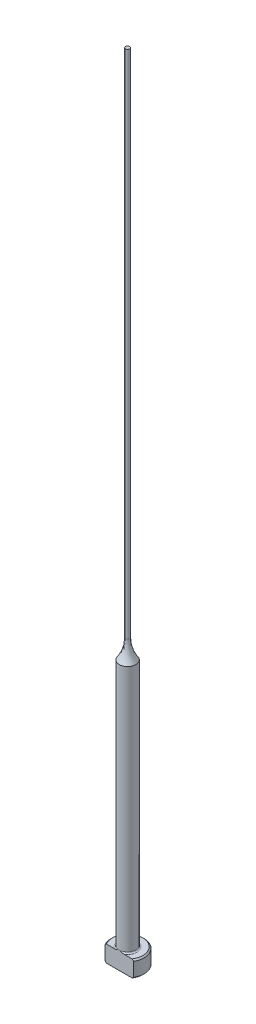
from build123d import *

# Parameters (mm, degrees)
CHAMFER1_SIZE = 0.254
FILLET1_R     = 0.254
KEY_DEPTH     = 153.466131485


with BuildPart() as part:
    # Sketch1 → Revolve1 (revolve)
    with BuildSketch(Plane.XY, mode=Mode.PRIVATE) as revolve1_sk:
        with BuildLine():
            Line((0, 0), (-3.175, 0))
            Line((-3.175, 0), (-3.175, 3.175))
            Line((-3.175, 3.175), (-1.5875, 3.175))
            Line((-1.5875, 3.175), (-1.5875, 50.8))
            ThreePointArc((-1.5875, 50.8), (-0.701386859, 52.557887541), (-0.39624, 54.50268843))
            Line((-0.39624, 54.50268843), (-0.39624, 152.4))
            Line((-0.39624, 152.4), (0, 152.4))
            Line((0, 152.4), (0, 0))
        make_face()
    revolve(revolve1_sk.sketch.rotate(Axis((0, 259.958771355, 0), (0, -1, 0)), 270), axis=Axis((0, 259.958771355, 0), (0, -1, 0)))

    # Chamfer1
    chamfer1_edges = [part.edges().sort_by_distance(p)[0] for p in [
        (0, 0, -3.175),
        (0, 3.175, -3.175),
    ]]
    chamfer(chamfer1_edges, length=CHAMFER1_SIZE)

    # Fillet1
    fillet1_edges = [part.edges().sort_by_distance(p)[0] for p in [
        (0, 3.175, -1.5875),
    ]]
    fillet(fillet1_edges, radius=FILLET1_R)

    # Sketch2 → KEY (cut, through all)
    with BuildSketch(Plane.XZ):
        with BuildLine():
            Line((-2.749630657, 1.5875), (2.749630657, 1.5875))
            ThreePointArc((2.749630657, 1.5875), (0, 3.175), (-2.749630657, 1.5875))
        make_face()
    extrude(amount=-KEY_DEPTH, mode=Mode.SUBTRACT)


solid = part.part
